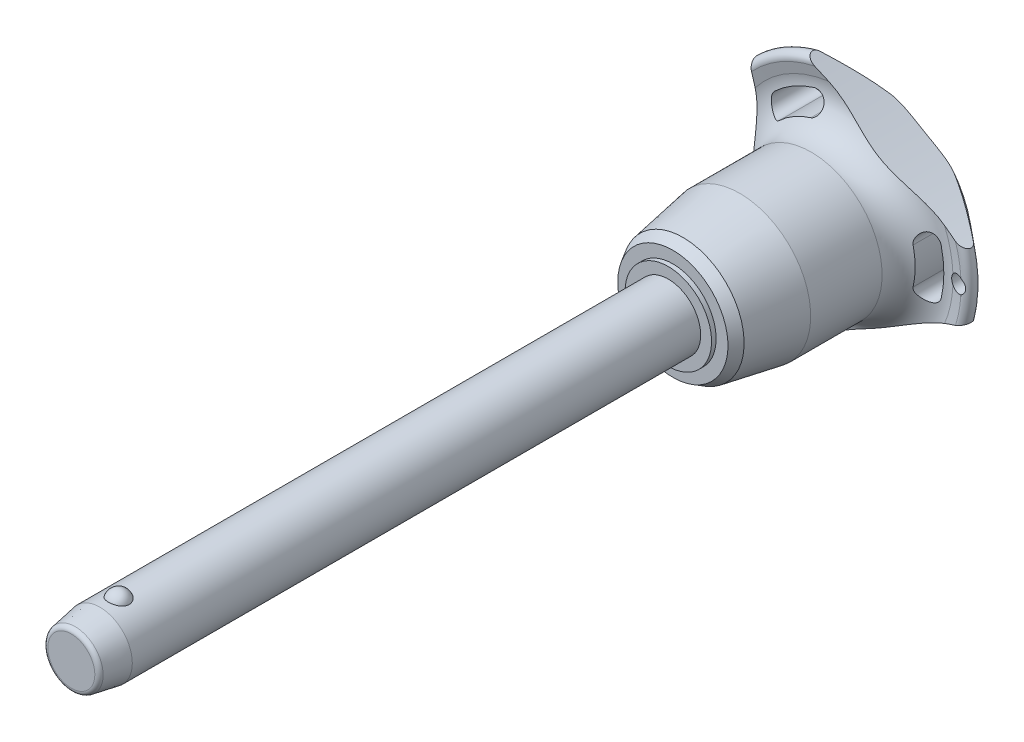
from build123d import *

# Parameters (mm, degrees)
SKETCH1_R           = 6
BOSS_EXTRUDE1_DEPTH = 100
SKETCH2_R           = 5.15
BOSS_EXTRUDE2_DEPTH = 39.7
BOSS_EXTRUDE3_START = 10.6
SKETCH1_2_R         = 6
BOSS_EXTRUDE3_DEPTH = 10.6
CHAMFER1_SIZE       = 5.3
CHAMFER1_SIZE2      = 0.934532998
FILLET1_R           = 0.85
SKETCH6_R           = 144.275
CUT_EXTRUDE1_DEPTH  = 144.700393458
CIRPATTERN1_COUNT   = 3
SKETCH7_R           = 1.5
CUT_EXTRUDE2_DEPTH  = 144.560667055


with BuildPart() as part:
    # Sketch1 → Boss-Extrude1 (new body)
    with BuildSketch(Plane.XY):
        Circle(SKETCH1_R)
    extrude(amount=-BOSS_EXTRUDE1_DEPTH)

    # Sketch2 → Boss-Extrude2 (add)
    with BuildSketch(Plane(origin=(0, 0, -100), x_dir=(-1, 0, 0), z_dir=(0, 0, -1))):
        Circle(SKETCH2_R)
    extrude(amount=BOSS_EXTRUDE2_DEPTH)

    # Sketch3 → Revolve1 (revolve)
    with BuildSketch(Plane(origin=(0, 0, 0), x_dir=(0, 0, -1), z_dir=(1, 0, 0))):
        with BuildLine():
            Line((-1.854049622, 7.25), (-1.854049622, 3.25))
            ThreePointArc((-1.854049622, 3.25), (0.145950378, 5.25), (-1.854049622, 7.25))
        make_face()
        with BuildLine():
            Line((-1.854049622, -3.25), (-1.854049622, -7.25))
            ThreePointArc((-1.854049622, -7.25), (0.145950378, -5.25), (-1.854049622, -3.25))
        make_face()
    revolve(axis=Axis((0, -3.25, 1.854049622), (0, 1, 0)))

    # Sketch1_2 → Boss-Extrude3 (add)
    with BuildSketch(Plane.XY.offset(BOSS_EXTRUDE3_START)):
        Circle(SKETCH1_2_R)
    extrude(amount=-BOSS_EXTRUDE3_DEPTH)

    # Chamfer1
    chamfer1_edges = [part.edges().sort_by_distance(p)[0] for p in [
        (-6, 0, 10.6),
    ]]
    chamfer1_side = [part.faces().sort_by_distance(p)[0] for p in [
        (-6, 0, -44.7),
    ]]
    chamfer(chamfer1_edges, length=CHAMFER1_SIZE, length2=CHAMFER1_SIZE2, reference=chamfer1_side[0])

    # Fillet1
    fillet1_edges = [part.edges().sort_by_distance(p)[0] for p in [
        (-5.065467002, 0, 10.6),
        (5.15, 0, -139.7),
    ]]
    fillet(fillet1_edges, radius=FILLET1_R)

    # Sketch4 → Revolve2 (revolve)
    with BuildSketch(Plane(origin=(0, 0, 0), x_dir=(0, 0, -1), z_dir=(1, 0, 0)), mode=Mode.PRIVATE) as revolve2_sk:
        Polygon((100, 0), (100, 8.017240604), (100.85, 8.017240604), (100.85, 10.206249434), (102.745737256, 11.300753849), (113.233333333, 13.15), (126.466666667, 13.15), (126.466666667, 0), align=None)
    revolve(revolve2_sk.sketch.rotate(Axis((0, 0, -126.466666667), (0, 0, 1)), 90), axis=Axis((0, 0, -126.466666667), (0, 0, 1)))

    # Sketch5 → Revolve3 (revolve)
    with BuildSketch(Plane(origin=(0, 0, 0), x_dir=(0, 0, -1), z_dir=(1, 0, 0)), mode=Mode.PRIVATE) as revolve3_sk:
        with BuildLine():
            Line((132.32877039, 20.428960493), (131.910912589, 22.344207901))
            ThreePointArc((131.910912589, 22.344207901), (132.554394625, 23.677136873), (134.002586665, 23.371345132))
            Line((134.002586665, 23.371345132), (139.141488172, 17.247040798))
            ThreePointArc((139.141488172, 17.247040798), (139.7, 15.584758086), (138.978803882, 13.986322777))
            ThreePointArc((138.978803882, 13.986322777), (134.617427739, 7.589034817), (133.083333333, 0))
            Line((133.083333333, 0), (126.466666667, 0))
            Line((126.466666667, 0), (126.466666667, 13.15))
            ThreePointArc((126.466666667, 13.15), (131.139661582, 15.38660811), (132.32877039, 20.428960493))
        make_face()
    revolve(revolve3_sk.sketch.rotate(Axis((0, 0, -133.083333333), (0, 0, 1)), 90), axis=Axis((0, 0, -133.083333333), (0, 0, 1)))

    # Sketch6 → Cut-Extrude1 (cut, through all)
    with BuildSketch(Plane.XY):
        with Locations((-159.975, 0)):
            Circle(SKETCH6_R)
        with BuildLine():
            ThreePointArc((18.131206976, -4.190753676), (18.60922037, 0), (18.131206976, 4.190753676))
            ThreePointArc((18.131206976, 4.190753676), (15.94840906, 5.553949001), (14.585213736, 3.371151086))
            ThreePointArc((14.585213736, 3.371151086), (14.969740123, 0), (14.585213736, -3.371151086))
            ThreePointArc((14.585213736, -3.371151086), (15.94840906, -5.553949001), (18.131206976, -4.190753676))
        make_face()
    cut_extrude1 = extrude(amount=-CUT_EXTRUDE1_DEPTH, mode=Mode.SUBTRACT)

    # CirPattern1: Cut-Extrude1 ×3 about axis
    cirpattern1_axis = Axis((0, 0, 0), (0, 0, 1))
    for i in range(1, CIRPATTERN1_COUNT):
        add(cut_extrude1.rotate(cirpattern1_axis, i * 360 / CIRPATTERN1_COUNT), mode=Mode.SUBTRACT)

    # Sketch7 → Cut-Extrude2 (cut, through all)
    with BuildSketch(Plane.XY):
        with Locations(Location((21.60922037, 0, 0), (0, 0, 297.620773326))):
            Circle(SKETCH7_R)
    extrude(amount=-CUT_EXTRUDE2_DEPTH, mode=Mode.SUBTRACT)


solid = part.part
